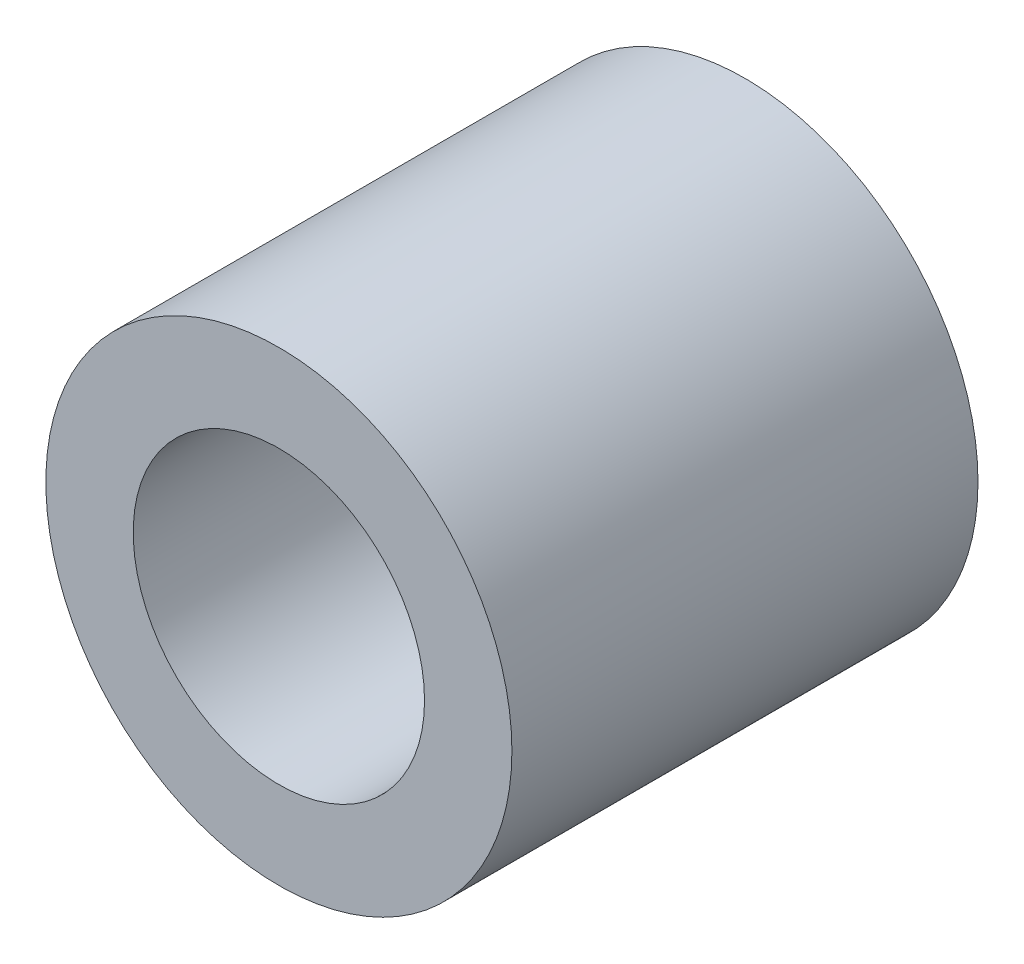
ISO-10303-21;
HEADER;
FILE_DESCRIPTION(('STEP AP214'),'2;1');
FILE_NAME('part.step','',(''),(''),'','','');
FILE_SCHEMA(('AUTOMOTIVE_DESIGN { 1 0 10303 214 1 1 1 1 }'));
ENDSEC;
DATA;
#1=APPLICATION_CONTEXT('core data for automotive mechanical design processes');
#2=APPLICATION_PROTOCOL_DEFINITION('international standard','automotive_design',2000,#1);
#3=PRODUCT_CONTEXT('',#1,'mechanical');
#4=PRODUCT('Part','Part','',(#3));
#5=PRODUCT_RELATED_PRODUCT_CATEGORY('part','',(#4));
#6=PRODUCT_DEFINITION_FORMATION('','',#4);
#7=PRODUCT_DEFINITION_CONTEXT('part definition',#1,'design');
#8=PRODUCT_DEFINITION('design','',#6,#7);
#9=PRODUCT_DEFINITION_SHAPE('','',#8);
#10=(LENGTH_UNIT() NAMED_UNIT(*) SI_UNIT(.MILLI.,.METRE.));
#11=(NAMED_UNIT(*) PLANE_ANGLE_UNIT() SI_UNIT($,.RADIAN.));
#12=(NAMED_UNIT(*) SI_UNIT($,.STERADIAN.) SOLID_ANGLE_UNIT());
#13=UNCERTAINTY_MEASURE_WITH_UNIT(LENGTH_MEASURE(1.E-05),#10,'distance_accuracy_value','');
#14=(GEOMETRIC_REPRESENTATION_CONTEXT(3) GLOBAL_UNCERTAINTY_ASSIGNED_CONTEXT((#13)) GLOBAL_UNIT_ASSIGNED_CONTEXT((#10,
#11,#12)) REPRESENTATION_CONTEXT('',''));
#15=CARTESIAN_POINT('',(0.,0.,0.));
#16=DIRECTION('',(0.,0.,1.));
#17=DIRECTION('',(1.,0.,0.));
#18=AXIS2_PLACEMENT_3D('',#15,#16,#17);
#19=CARTESIAN_POINT('',(0.,0.,1.6));
#20=DIRECTION('',(0.,0.,1.));
#21=DIRECTION('',(1.,0.,0.));
#22=AXIS2_PLACEMENT_3D('',#19,#20,#21);
#23=PLANE('',#22);
#24=CARTESIAN_POINT('',(0.,0.,1.6));
#25=DIRECTION('',(0.,0.,1.));
#26=DIRECTION('',(1.,0.,0.));
#27=AXIS2_PLACEMENT_3D('',#24,#25,#26);
#28=CIRCLE('',#27,0.8);
#29=CARTESIAN_POINT('',(0.8,0.,1.6));
#30=VERTEX_POINT('',#29);
#31=EDGE_CURVE('E10',#30,#30,#28,.T.);
#32=ORIENTED_EDGE('',*,*,#31,.T.);
#33=EDGE_LOOP('',(#32));
#34=FACE_BOUND('',#33,.T.);
#35=CARTESIAN_POINT('',(0.,0.,1.6));
#36=DIRECTION('',(0.,0.,1.));
#37=DIRECTION('',(1.,0.,0.));
#38=AXIS2_PLACEMENT_3D('',#35,#36,#37);
#39=CIRCLE('',#38,0.5);
#40=CARTESIAN_POINT('',(0.5,0.,1.6));
#41=VERTEX_POINT('',#40);
#42=EDGE_CURVE('E50',#41,#41,#39,.T.);
#43=ORIENTED_EDGE('',*,*,#42,.F.);
#44=EDGE_LOOP('',(#43));
#45=FACE_BOUND('',#44,.T.);
#46=ADVANCED_FACE('F37',(#34,#45),#23,.T.);
#47=CARTESIAN_POINT('',(0.,0.,0.));
#48=DIRECTION('',(0.,0.,1.));
#49=DIRECTION('',(1.,0.,0.));
#50=AXIS2_PLACEMENT_3D('',#47,#48,#49);
#51=PLANE('',#50);
#52=CARTESIAN_POINT('',(0.,0.,0.));
#53=DIRECTION('',(0.,0.,1.));
#54=DIRECTION('',(1.,0.,0.));
#55=AXIS2_PLACEMENT_3D('',#52,#53,#54);
#56=CIRCLE('',#55,0.8);
#57=CARTESIAN_POINT('',(0.8,0.,0.));
#58=VERTEX_POINT('',#57);
#59=EDGE_CURVE('E41',#58,#58,#56,.T.);
#60=ORIENTED_EDGE('',*,*,#59,.F.);
#61=EDGE_LOOP('',(#60));
#62=FACE_BOUND('',#61,.T.);
#63=CARTESIAN_POINT('',(0.,0.,0.));
#64=DIRECTION('',(0.,0.,1.));
#65=DIRECTION('',(1.,0.,0.));
#66=AXIS2_PLACEMENT_3D('',#63,#64,#65);
#67=CIRCLE('',#66,0.5);
#68=CARTESIAN_POINT('',(0.5,0.,0.));
#69=VERTEX_POINT('',#68);
#70=EDGE_CURVE('E52',#69,#69,#67,.T.);
#71=ORIENTED_EDGE('',*,*,#70,.T.);
#72=EDGE_LOOP('',(#71));
#73=FACE_BOUND('',#72,.T.);
#74=ADVANCED_FACE('F64',(#62,#73),#51,.F.);
#75=CARTESIAN_POINT('',(0.,0.,1.6));
#76=DIRECTION('',(0.,0.,-1.));
#77=DIRECTION('',(-1.,0.,0.));
#78=AXIS2_PLACEMENT_3D('',#75,#76,#77);
#79=CYLINDRICAL_SURFACE('',#78,0.8);
#80=ORIENTED_EDGE('',*,*,#31,.F.);
#81=EDGE_LOOP('',(#80));
#82=FACE_BOUND('',#81,.T.);
#83=ORIENTED_EDGE('',*,*,#59,.T.);
#84=EDGE_LOOP('',(#83));
#85=FACE_BOUND('',#84,.T.);
#86=ADVANCED_FACE('F39',(#82,#85),#79,.T.);
#87=CARTESIAN_POINT('',(0.,0.,1.6));
#88=DIRECTION('',(0.,0.,-1.));
#89=DIRECTION('',(-1.,0.,0.));
#90=AXIS2_PLACEMENT_3D('',#87,#88,#89);
#91=CYLINDRICAL_SURFACE('',#90,0.5);
#92=ORIENTED_EDGE('',*,*,#42,.T.);
#93=EDGE_LOOP('',(#92));
#94=FACE_BOUND('',#93,.T.);
#95=ORIENTED_EDGE('',*,*,#70,.F.);
#96=EDGE_LOOP('',(#95));
#97=FACE_BOUND('',#96,.T.);
#98=ADVANCED_FACE('F60',(#94,#97),#91,.F.);
#99=CLOSED_SHELL('',(#46,#74,#86,#98));
#100=MANIFOLD_SOLID_BREP('B2',#99);
#101=ADVANCED_BREP_SHAPE_REPRESENTATION('',(#18,#100),#14);
#102=SHAPE_DEFINITION_REPRESENTATION(#9,#101);
ENDSEC;
END-ISO-10303-21;
